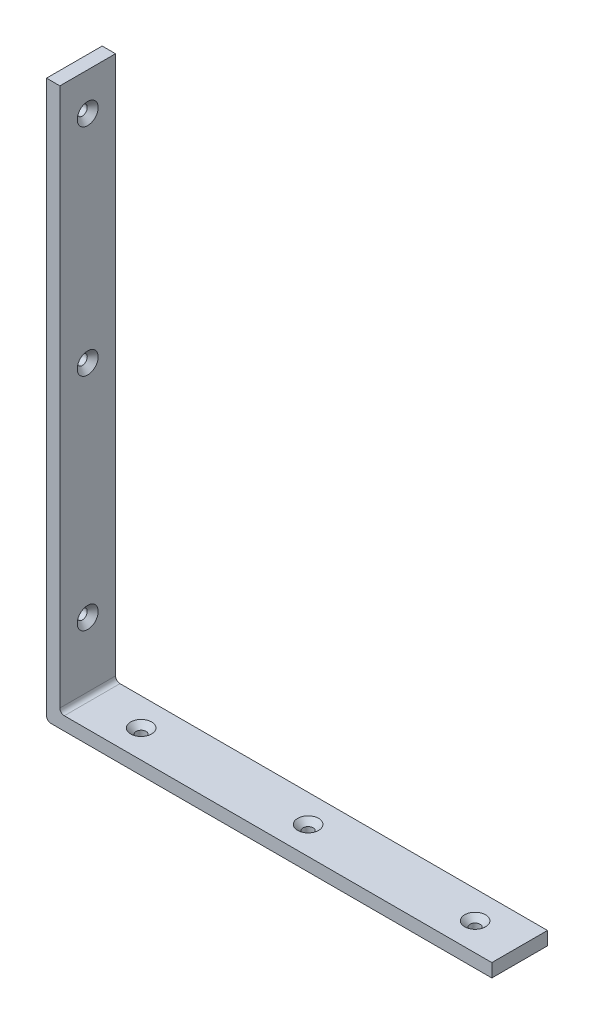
ISO-10303-21;
HEADER;
FILE_DESCRIPTION(('STEP AP214'),'2;1');
FILE_NAME('part.step','',(''),(''),'','','');
FILE_SCHEMA(('AUTOMOTIVE_DESIGN { 1 0 10303 214 1 1 1 1 }'));
ENDSEC;
DATA;
#1=APPLICATION_CONTEXT('core data for automotive mechanical design processes');
#2=APPLICATION_PROTOCOL_DEFINITION('international standard','automotive_design',2000,#1);
#3=PRODUCT_CONTEXT('',#1,'mechanical');
#4=PRODUCT('Part','Part','',(#3));
#5=PRODUCT_RELATED_PRODUCT_CATEGORY('part','',(#4));
#6=PRODUCT_DEFINITION_FORMATION('','',#4);
#7=PRODUCT_DEFINITION_CONTEXT('part definition',#1,'design');
#8=PRODUCT_DEFINITION('design','',#6,#7);
#9=PRODUCT_DEFINITION_SHAPE('','',#8);
#10=(LENGTH_UNIT() NAMED_UNIT(*) SI_UNIT(.MILLI.,.METRE.));
#11=(NAMED_UNIT(*) PLANE_ANGLE_UNIT() SI_UNIT($,.RADIAN.));
#12=(NAMED_UNIT(*) SI_UNIT($,.STERADIAN.) SOLID_ANGLE_UNIT());
#13=UNCERTAINTY_MEASURE_WITH_UNIT(LENGTH_MEASURE(1.E-05),#10,'distance_accuracy_value','');
#14=(GEOMETRIC_REPRESENTATION_CONTEXT(3) GLOBAL_UNCERTAINTY_ASSIGNED_CONTEXT((#13)) GLOBAL_UNIT_ASSIGNED_CONTEXT((#10,
#11,#12)) REPRESENTATION_CONTEXT('',''));
#15=CARTESIAN_POINT('',(0.,0.,0.));
#16=DIRECTION('',(0.,0.,1.));
#17=DIRECTION('',(1.,0.,0.));
#18=AXIS2_PLACEMENT_3D('',#15,#16,#17);
#19=CARTESIAN_POINT('',(100.,-119.,25.));
#20=DIRECTION('',(1.,0.,0.));
#21=DIRECTION('',(0.,0.,-1.));
#22=AXIS2_PLACEMENT_3D('',#19,#20,#21);
#23=PLANE('',#22);
#24=DIRECTION('',(0.,-1.,0.));
#25=VECTOR('',#24,1.);
#26=CARTESIAN_POINT('',(100.,-119.,0.));
#27=LINE('',#26,#25);
#28=CARTESIAN_POINT('',(100.,-119.,0.));
#29=VERTEX_POINT('',#28);
#30=CARTESIAN_POINT('',(100.,-125.,0.));
#31=VERTEX_POINT('',#30);
#32=EDGE_CURVE('E137',#29,#31,#27,.T.);
#33=ORIENTED_EDGE('',*,*,#32,.F.);
#34=DIRECTION('',(0.,0.,-1.));
#35=VECTOR('',#34,1.);
#36=CARTESIAN_POINT('',(100.,-119.,25.));
#37=LINE('',#36,#35);
#38=CARTESIAN_POINT('',(100.,-119.,25.));
#39=VERTEX_POINT('',#38);
#40=EDGE_CURVE('E120',#39,#29,#37,.T.);
#41=ORIENTED_EDGE('',*,*,#40,.F.);
#42=DIRECTION('',(0.,-1.,0.));
#43=VECTOR('',#42,1.);
#44=CARTESIAN_POINT('',(100.,-119.,25.));
#45=LINE('',#44,#43);
#46=CARTESIAN_POINT('',(100.,-125.,25.));
#47=VERTEX_POINT('',#46);
#48=EDGE_CURVE('E114',#39,#47,#45,.T.);
#49=ORIENTED_EDGE('',*,*,#48,.T.);
#50=DIRECTION('',(0.,0.,-1.));
#51=VECTOR('',#50,1.);
#52=CARTESIAN_POINT('',(100.,-125.,25.));
#53=LINE('',#52,#51);
#54=EDGE_CURVE('E96',#47,#31,#53,.T.);
#55=ORIENTED_EDGE('',*,*,#54,.T.);
#56=EDGE_LOOP('',(#33,#41,#49,#55));
#57=FACE_BOUND('',#56,.T.);
#58=ADVANCED_FACE('F33',(#57),#23,.T.);
#59=CARTESIAN_POINT('',(-94.,-119.,25.));
#60=DIRECTION('',(0.,1.,0.));
#61=DIRECTION('',(0.,0.,1.));
#62=AXIS2_PLACEMENT_3D('',#59,#60,#61);
#63=PLANE('',#62);
#64=CARTESIAN_POINT('',(-70.,-119.,12.5));
#65=DIRECTION('',(0.,1.,0.));
#66=DIRECTION('',(0.,0.,1.));
#67=AXIS2_PLACEMENT_3D('',#64,#65,#66);
#68=CIRCLE('',#67,4.7);
#69=CARTESIAN_POINT('',(-70.,-119.,17.2));
#70=VERTEX_POINT('',#69);
#71=EDGE_CURVE('E290',#70,#70,#68,.T.);
#72=ORIENTED_EDGE('',*,*,#71,.F.);
#73=EDGE_LOOP('',(#72));
#74=FACE_BOUND('',#73,.T.);
#75=CARTESIAN_POINT('',(5.,-119.,12.5));
#76=DIRECTION('',(0.,1.,0.));
#77=DIRECTION('',(0.,0.,1.));
#78=AXIS2_PLACEMENT_3D('',#75,#76,#77);
#79=CIRCLE('',#78,4.7);
#80=CARTESIAN_POINT('',(5.,-119.,17.2));
#81=VERTEX_POINT('',#80);
#82=EDGE_CURVE('E299',#81,#81,#79,.T.);
#83=ORIENTED_EDGE('',*,*,#82,.F.);
#84=EDGE_LOOP('',(#83));
#85=FACE_BOUND('',#84,.T.);
#86=CARTESIAN_POINT('',(80.,-119.,12.5));
#87=DIRECTION('',(0.,1.,0.));
#88=DIRECTION('',(0.,0.,1.));
#89=AXIS2_PLACEMENT_3D('',#86,#87,#88);
#90=CIRCLE('',#89,4.7);
#91=CARTESIAN_POINT('',(80.,-119.,17.2));
#92=VERTEX_POINT('',#91);
#93=EDGE_CURVE('E308',#92,#92,#90,.T.);
#94=ORIENTED_EDGE('',*,*,#93,.F.);
#95=EDGE_LOOP('',(#94));
#96=FACE_BOUND('',#95,.T.);
#97=DIRECTION('',(1.,0.,0.));
#98=VECTOR('',#97,1.);
#99=CARTESIAN_POINT('',(-94.,-119.,0.));
#100=LINE('',#99,#98);
#101=CARTESIAN_POINT('',(-92.,-119.,0.));
#102=VERTEX_POINT('',#101);
#103=EDGE_CURVE('E121',#102,#29,#100,.T.);
#104=ORIENTED_EDGE('',*,*,#103,.F.);
#105=DIRECTION('',(0.,0.,-1.));
#106=VECTOR('',#105,1.);
#107=CARTESIAN_POINT('',(-92.,-119.,25.));
#108=LINE('',#107,#106);
#109=CARTESIAN_POINT('',(-92.,-119.,25.));
#110=VERTEX_POINT('',#109);
#111=EDGE_CURVE('E155',#102,#110,#108,.F.);
#112=ORIENTED_EDGE('',*,*,#111,.T.);
#113=DIRECTION('',(1.,0.,0.));
#114=VECTOR('',#113,1.);
#115=CARTESIAN_POINT('',(-94.,-119.,25.));
#116=LINE('',#115,#114);
#117=EDGE_CURVE('E108',#110,#39,#116,.T.);
#118=ORIENTED_EDGE('',*,*,#117,.T.);
#119=ORIENTED_EDGE('',*,*,#40,.T.);
#120=EDGE_LOOP('',(#104,#112,#118,#119));
#121=FACE_BOUND('',#120,.T.);
#122=ADVANCED_FACE('F168',(#74,#85,#96,#121),#63,.T.);
#123=CARTESIAN_POINT('',(-94.,125.,25.));
#124=DIRECTION('',(1.,0.,0.));
#125=DIRECTION('',(0.,1.,0.));
#126=AXIS2_PLACEMENT_3D('',#123,#124,#125);
#127=PLANE('',#126);
#128=CARTESIAN_POINT('',(-94.,-88.,12.5));
#129=DIRECTION('',(1.,0.,0.));
#130=DIRECTION('',(0.,0.,-1.));
#131=AXIS2_PLACEMENT_3D('',#128,#129,#130);
#132=CIRCLE('',#131,4.7);
#133=CARTESIAN_POINT('',(-94.,-88.,7.80000000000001));
#134=VERTEX_POINT('',#133);
#135=EDGE_CURVE('E265',#134,#134,#132,.T.);
#136=ORIENTED_EDGE('',*,*,#135,.F.);
#137=EDGE_LOOP('',(#136));
#138=FACE_BOUND('',#137,.T.);
#139=CARTESIAN_POINT('',(-94.,11.,12.5));
#140=DIRECTION('',(1.,0.,0.));
#141=DIRECTION('',(0.,0.,-1.));
#142=AXIS2_PLACEMENT_3D('',#139,#140,#141);
#143=CIRCLE('',#142,4.7);
#144=CARTESIAN_POINT('',(-94.,11.,7.8));
#145=VERTEX_POINT('',#144);
#146=EDGE_CURVE('E272',#145,#145,#143,.T.);
#147=ORIENTED_EDGE('',*,*,#146,.F.);
#148=EDGE_LOOP('',(#147));
#149=FACE_BOUND('',#148,.T.);
#150=CARTESIAN_POINT('',(-94.,108.,12.5));
#151=DIRECTION('',(1.,0.,0.));
#152=DIRECTION('',(0.,0.,-1.));
#153=AXIS2_PLACEMENT_3D('',#150,#151,#152);
#154=CIRCLE('',#153,4.7);
#155=CARTESIAN_POINT('',(-94.,108.,7.80000000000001));
#156=VERTEX_POINT('',#155);
#157=EDGE_CURVE('E281',#156,#156,#154,.T.);
#158=ORIENTED_EDGE('',*,*,#157,.F.);
#159=EDGE_LOOP('',(#158));
#160=FACE_BOUND('',#159,.T.);
#161=DIRECTION('',(0.,-1.,0.));
#162=VECTOR('',#161,1.);
#163=CARTESIAN_POINT('',(-94.,125.,25.));
#164=LINE('',#163,#162);
#165=CARTESIAN_POINT('',(-94.,125.,25.));
#166=VERTEX_POINT('',#165);
#167=CARTESIAN_POINT('',(-94.,-117.,25.));
#168=VERTEX_POINT('',#167);
#169=EDGE_CURVE('E133',#166,#168,#164,.T.);
#170=ORIENTED_EDGE('',*,*,#169,.T.);
#171=DIRECTION('',(0.,0.,-1.));
#172=VECTOR('',#171,1.);
#173=CARTESIAN_POINT('',(-94.,-117.,0.));
#174=LINE('',#173,#172);
#175=CARTESIAN_POINT('',(-94.,-117.,0.));
#176=VERTEX_POINT('',#175);
#177=EDGE_CURVE('E148',#168,#176,#174,.T.);
#178=ORIENTED_EDGE('',*,*,#177,.T.);
#179=DIRECTION('',(0.,-1.,0.));
#180=VECTOR('',#179,1.);
#181=CARTESIAN_POINT('',(-94.,125.,0.));
#182=LINE('',#181,#180);
#183=CARTESIAN_POINT('',(-94.,125.,0.));
#184=VERTEX_POINT('',#183);
#185=EDGE_CURVE('E123',#184,#176,#182,.T.);
#186=ORIENTED_EDGE('',*,*,#185,.F.);
#187=DIRECTION('',(0.,0.,-1.));
#188=VECTOR('',#187,1.);
#189=CARTESIAN_POINT('',(-94.,125.,25.));
#190=LINE('',#189,#188);
#191=EDGE_CURVE('E149',#166,#184,#190,.T.);
#192=ORIENTED_EDGE('',*,*,#191,.F.);
#193=EDGE_LOOP('',(#170,#178,#186,#192));
#194=FACE_BOUND('',#193,.T.);
#195=ADVANCED_FACE('F176',(#138,#149,#160,#194),#127,.T.);
#196=CARTESIAN_POINT('',(-100.,125.,25.));
#197=DIRECTION('',(0.,1.,0.));
#198=DIRECTION('',(-1.,0.,0.));
#199=AXIS2_PLACEMENT_3D('',#196,#197,#198);
#200=PLANE('',#199);
#201=DIRECTION('',(1.,0.,0.));
#202=VECTOR('',#201,1.);
#203=CARTESIAN_POINT('',(-100.,125.,0.));
#204=LINE('',#203,#202);
#205=CARTESIAN_POINT('',(-100.,125.,0.));
#206=VERTEX_POINT('',#205);
#207=EDGE_CURVE('E142',#206,#184,#204,.T.);
#208=ORIENTED_EDGE('',*,*,#207,.F.);
#209=DIRECTION('',(0.,0.,-1.));
#210=VECTOR('',#209,1.);
#211=CARTESIAN_POINT('',(-100.,125.,25.));
#212=LINE('',#211,#210);
#213=CARTESIAN_POINT('',(-100.,125.,25.));
#214=VERTEX_POINT('',#213);
#215=EDGE_CURVE('E107',#214,#206,#212,.T.);
#216=ORIENTED_EDGE('',*,*,#215,.F.);
#217=DIRECTION('',(1.,0.,0.));
#218=VECTOR('',#217,1.);
#219=CARTESIAN_POINT('',(-100.,125.,25.));
#220=LINE('',#219,#218);
#221=EDGE_CURVE('E130',#214,#166,#220,.T.);
#222=ORIENTED_EDGE('',*,*,#221,.T.);
#223=ORIENTED_EDGE('',*,*,#191,.T.);
#224=EDGE_LOOP('',(#208,#216,#222,#223));
#225=FACE_BOUND('',#224,.T.);
#226=ADVANCED_FACE('F180',(#225),#200,.T.);
#227=CARTESIAN_POINT('',(-100.,-125.,25.));
#228=DIRECTION('',(-1.,0.,0.));
#229=DIRECTION('',(0.,0.,1.));
#230=AXIS2_PLACEMENT_3D('',#227,#228,#229);
#231=PLANE('',#230);
#232=CARTESIAN_POINT('',(-100.,-88.,12.5));
#233=DIRECTION('',(1.,0.,0.));
#234=DIRECTION('',(0.,0.,-1.));
#235=AXIS2_PLACEMENT_3D('',#232,#233,#234);
#236=CIRCLE('',#235,2.25);
#237=CARTESIAN_POINT('',(-100.,-88.,10.25));
#238=VERTEX_POINT('',#237);
#239=EDGE_CURVE('E267',#238,#238,#236,.T.);
#240=ORIENTED_EDGE('',*,*,#239,.T.);
#241=EDGE_LOOP('',(#240));
#242=FACE_BOUND('',#241,.T.);
#243=CARTESIAN_POINT('',(-100.,11.,12.5));
#244=DIRECTION('',(1.,0.,0.));
#245=DIRECTION('',(0.,0.,-1.));
#246=AXIS2_PLACEMENT_3D('',#243,#244,#245);
#247=CIRCLE('',#246,2.25);
#248=CARTESIAN_POINT('',(-100.,11.,10.25));
#249=VERTEX_POINT('',#248);
#250=EDGE_CURVE('E278',#249,#249,#247,.T.);
#251=ORIENTED_EDGE('',*,*,#250,.T.);
#252=EDGE_LOOP('',(#251));
#253=FACE_BOUND('',#252,.T.);
#254=CARTESIAN_POINT('',(-100.,108.,12.5));
#255=DIRECTION('',(1.,0.,0.));
#256=DIRECTION('',(0.,0.,-1.));
#257=AXIS2_PLACEMENT_3D('',#254,#255,#256);
#258=CIRCLE('',#257,2.25);
#259=CARTESIAN_POINT('',(-100.,108.,10.25));
#260=VERTEX_POINT('',#259);
#261=EDGE_CURVE('E287',#260,#260,#258,.T.);
#262=ORIENTED_EDGE('',*,*,#261,.T.);
#263=EDGE_LOOP('',(#262));
#264=FACE_BOUND('',#263,.T.);
#265=DIRECTION('',(0.,1.,0.));
#266=VECTOR('',#265,1.);
#267=CARTESIAN_POINT('',(-100.,-125.,0.));
#268=LINE('',#267,#266);
#269=CARTESIAN_POINT('',(-100.,-123.,0.));
#270=VERTEX_POINT('',#269);
#271=EDGE_CURVE('E140',#270,#206,#268,.T.);
#272=ORIENTED_EDGE('',*,*,#271,.F.);
#273=DIRECTION('',(0.,0.,-1.));
#274=VECTOR('',#273,1.);
#275=CARTESIAN_POINT('',(-100.,-123.,25.));
#276=LINE('',#275,#274);
#277=CARTESIAN_POINT('',(-100.,-123.,25.));
#278=VERTEX_POINT('',#277);
#279=EDGE_CURVE('E41',#270,#278,#276,.F.);
#280=ORIENTED_EDGE('',*,*,#279,.T.);
#281=DIRECTION('',(0.,1.,0.));
#282=VECTOR('',#281,1.);
#283=CARTESIAN_POINT('',(-100.,-125.,25.));
#284=LINE('',#283,#282);
#285=EDGE_CURVE('E116',#278,#214,#284,.T.);
#286=ORIENTED_EDGE('',*,*,#285,.T.);
#287=ORIENTED_EDGE('',*,*,#215,.T.);
#288=EDGE_LOOP('',(#272,#280,#286,#287));
#289=FACE_BOUND('',#288,.T.);
#290=ADVANCED_FACE('F201',(#242,#253,#264,#289),#231,.T.);
#291=CARTESIAN_POINT('',(100.,-125.,25.));
#292=DIRECTION('',(0.,-1.,0.));
#293=DIRECTION('',(1.,0.,0.));
#294=AXIS2_PLACEMENT_3D('',#291,#292,#293);
#295=PLANE('',#294);
#296=CARTESIAN_POINT('',(-70.,-125.,12.5));
#297=DIRECTION('',(0.,1.,0.));
#298=DIRECTION('',(0.,0.,1.));
#299=AXIS2_PLACEMENT_3D('',#296,#297,#298);
#300=CIRCLE('',#299,2.25);
#301=CARTESIAN_POINT('',(-70.,-125.,14.75));
#302=VERTEX_POINT('',#301);
#303=EDGE_CURVE('E296',#302,#302,#300,.T.);
#304=ORIENTED_EDGE('',*,*,#303,.T.);
#305=EDGE_LOOP('',(#304));
#306=FACE_BOUND('',#305,.T.);
#307=CARTESIAN_POINT('',(5.,-125.,12.5));
#308=DIRECTION('',(0.,1.,0.));
#309=DIRECTION('',(0.,0.,1.));
#310=AXIS2_PLACEMENT_3D('',#307,#308,#309);
#311=CIRCLE('',#310,2.25);
#312=CARTESIAN_POINT('',(5.,-125.,14.75));
#313=VERTEX_POINT('',#312);
#314=EDGE_CURVE('E305',#313,#313,#311,.T.);
#315=ORIENTED_EDGE('',*,*,#314,.T.);
#316=EDGE_LOOP('',(#315));
#317=FACE_BOUND('',#316,.T.);
#318=CARTESIAN_POINT('',(80.,-125.,12.5));
#319=DIRECTION('',(0.,1.,0.));
#320=DIRECTION('',(0.,0.,1.));
#321=AXIS2_PLACEMENT_3D('',#318,#319,#320);
#322=CIRCLE('',#321,2.25);
#323=CARTESIAN_POINT('',(80.,-125.,14.75));
#324=VERTEX_POINT('',#323);
#325=EDGE_CURVE('E126',#324,#324,#322,.T.);
#326=ORIENTED_EDGE('',*,*,#325,.T.);
#327=EDGE_LOOP('',(#326));
#328=FACE_BOUND('',#327,.T.);
#329=DIRECTION('',(-1.,0.,0.));
#330=VECTOR('',#329,1.);
#331=CARTESIAN_POINT('',(100.,-125.,25.));
#332=LINE('',#331,#330);
#333=CARTESIAN_POINT('',(-98.,-125.,25.));
#334=VERTEX_POINT('',#333);
#335=EDGE_CURVE('E100',#47,#334,#332,.T.);
#336=ORIENTED_EDGE('',*,*,#335,.T.);
#337=DIRECTION('',(0.,0.,-1.));
#338=VECTOR('',#337,1.);
#339=CARTESIAN_POINT('',(-98.,-125.,25.));
#340=LINE('',#339,#338);
#341=CARTESIAN_POINT('',(-98.,-125.,0.));
#342=VERTEX_POINT('',#341);
#343=EDGE_CURVE('E161',#334,#342,#340,.T.);
#344=ORIENTED_EDGE('',*,*,#343,.T.);
#345=DIRECTION('',(-1.,0.,0.));
#346=VECTOR('',#345,1.);
#347=CARTESIAN_POINT('',(100.,-125.,0.));
#348=LINE('',#347,#346);
#349=EDGE_CURVE('E102',#31,#342,#348,.T.);
#350=ORIENTED_EDGE('',*,*,#349,.F.);
#351=ORIENTED_EDGE('',*,*,#54,.F.);
#352=EDGE_LOOP('',(#336,#344,#350,#351));
#353=FACE_BOUND('',#352,.T.);
#354=ADVANCED_FACE('F98',(#306,#317,#328,#353),#295,.T.);
#355=CARTESIAN_POINT('',(0.,0.,25.));
#356=DIRECTION('',(0.,0.,-1.));
#357=DIRECTION('',(-1.,0.,0.));
#358=AXIS2_PLACEMENT_3D('',#355,#356,#357);
#359=PLANE('',#358);
#360=ORIENTED_EDGE('',*,*,#285,.F.);
#361=CARTESIAN_POINT('',(-98.,-123.,25.));
#362=DIRECTION('',(0.,0.,-1.));
#363=DIRECTION('',(-1.,0.,0.));
#364=AXIS2_PLACEMENT_3D('',#361,#362,#363);
#365=CIRCLE('',#364,2.);
#366=EDGE_CURVE('E11',#278,#334,#365,.F.);
#367=ORIENTED_EDGE('',*,*,#366,.T.);
#368=ORIENTED_EDGE('',*,*,#335,.F.);
#369=ORIENTED_EDGE('',*,*,#48,.F.);
#370=ORIENTED_EDGE('',*,*,#117,.F.);
#371=CARTESIAN_POINT('',(-92.,-117.,25.));
#372=DIRECTION('',(0.,0.,-1.));
#373=DIRECTION('',(-1.,0.,0.));
#374=AXIS2_PLACEMENT_3D('',#371,#372,#373);
#375=CIRCLE('',#374,2.);
#376=EDGE_CURVE('E159',#110,#168,#375,.T.);
#377=ORIENTED_EDGE('',*,*,#376,.T.);
#378=ORIENTED_EDGE('',*,*,#169,.F.);
#379=ORIENTED_EDGE('',*,*,#221,.F.);
#380=EDGE_LOOP('',(#360,#367,#368,#369,#370,#377,#378,#379));
#381=FACE_BOUND('',#380,.T.);
#382=ADVANCED_FACE('F112',(#381),#359,.F.);
#383=CARTESIAN_POINT('',(0.,0.,0.));
#384=DIRECTION('',(0.,0.,-1.));
#385=DIRECTION('',(-1.,0.,0.));
#386=AXIS2_PLACEMENT_3D('',#383,#384,#385);
#387=PLANE('',#386);
#388=ORIENTED_EDGE('',*,*,#349,.T.);
#389=CARTESIAN_POINT('',(-98.,-123.,0.));
#390=DIRECTION('',(0.,0.,-1.));
#391=DIRECTION('',(-1.,0.,0.));
#392=AXIS2_PLACEMENT_3D('',#389,#390,#391);
#393=CIRCLE('',#392,2.);
#394=EDGE_CURVE('E55',#342,#270,#393,.T.);
#395=ORIENTED_EDGE('',*,*,#394,.T.);
#396=ORIENTED_EDGE('',*,*,#271,.T.);
#397=ORIENTED_EDGE('',*,*,#207,.T.);
#398=ORIENTED_EDGE('',*,*,#185,.T.);
#399=CARTESIAN_POINT('',(-92.,-117.,0.));
#400=DIRECTION('',(0.,0.,-1.));
#401=DIRECTION('',(-1.,0.,0.));
#402=AXIS2_PLACEMENT_3D('',#399,#400,#401);
#403=CIRCLE('',#402,2.);
#404=EDGE_CURVE('E157',#176,#102,#403,.F.);
#405=ORIENTED_EDGE('',*,*,#404,.T.);
#406=ORIENTED_EDGE('',*,*,#103,.T.);
#407=ORIENTED_EDGE('',*,*,#32,.T.);
#408=EDGE_LOOP('',(#388,#395,#396,#397,#398,#405,#406,#407));
#409=FACE_BOUND('',#408,.T.);
#410=ADVANCED_FACE('F164',(#409),#387,.T.);
#411=CARTESIAN_POINT('',(-92.,-117.,25.));
#412=DIRECTION('',(0.,0.,1.));
#413=DIRECTION('',(1.,0.,0.));
#414=AXIS2_PLACEMENT_3D('',#411,#412,#413);
#415=CYLINDRICAL_SURFACE('',#414,2.);
#416=ORIENTED_EDGE('',*,*,#376,.F.);
#417=ORIENTED_EDGE('',*,*,#111,.F.);
#418=ORIENTED_EDGE('',*,*,#404,.F.);
#419=ORIENTED_EDGE('',*,*,#177,.F.);
#420=EDGE_LOOP('',(#416,#417,#418,#419));
#421=FACE_BOUND('',#420,.T.);
#422=ADVANCED_FACE('F173',(#421),#415,.F.);
#423=CARTESIAN_POINT('',(-98.,-123.,25.));
#424=DIRECTION('',(0.,0.,-1.));
#425=DIRECTION('',(-1.,0.,0.));
#426=AXIS2_PLACEMENT_3D('',#423,#424,#425);
#427=CYLINDRICAL_SURFACE('',#426,2.);
#428=ORIENTED_EDGE('',*,*,#366,.F.);
#429=ORIENTED_EDGE('',*,*,#279,.F.);
#430=ORIENTED_EDGE('',*,*,#394,.F.);
#431=ORIENTED_EDGE('',*,*,#343,.F.);
#432=EDGE_LOOP('',(#428,#429,#430,#431));
#433=FACE_BOUND('',#432,.T.);
#434=ADVANCED_FACE('F35',(#433),#427,.T.);
#435=CARTESIAN_POINT('',(80.,-119.,12.5));
#436=DIRECTION('',(0.,1.,0.));
#437=DIRECTION('',(0.,0.,1.));
#438=AXIS2_PLACEMENT_3D('',#435,#436,#437);
#439=CYLINDRICAL_SURFACE('',#438,2.25);
#440=ORIENTED_EDGE('',*,*,#325,.F.);
#441=EDGE_LOOP('',(#440));
#442=FACE_BOUND('',#441,.T.);
#443=CARTESIAN_POINT('',(80.,-121.45,12.5));
#444=DIRECTION('',(0.,1.,0.));
#445=DIRECTION('',(0.,0.,1.));
#446=AXIS2_PLACEMENT_3D('',#443,#444,#445);
#447=CIRCLE('',#446,2.25);
#448=CARTESIAN_POINT('',(80.,-121.45,14.75));
#449=VERTEX_POINT('',#448);
#450=EDGE_CURVE('E310',#449,#449,#447,.T.);
#451=ORIENTED_EDGE('',*,*,#450,.T.);
#452=EDGE_LOOP('',(#451));
#453=FACE_BOUND('',#452,.T.);
#454=ADVANCED_FACE('F183',(#442,#453),#439,.F.);
#455=CARTESIAN_POINT('',(80.,-119.,12.5));
#456=DIRECTION('',(0.,1.,0.));
#457=DIRECTION('',(0.,0.,1.));
#458=AXIS2_PLACEMENT_3D('',#455,#456,#457);
#459=CONICAL_SURFACE('',#458,4.7,0.785398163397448);
#460=ORIENTED_EDGE('',*,*,#450,.F.);
#461=EDGE_LOOP('',(#460));
#462=FACE_BOUND('',#461,.T.);
#463=ORIENTED_EDGE('',*,*,#93,.T.);
#464=EDGE_LOOP('',(#463));
#465=FACE_BOUND('',#464,.T.);
#466=ADVANCED_FACE('F188',(#462,#465),#459,.F.);
#467=CARTESIAN_POINT('',(5.,-119.,12.5));
#468=DIRECTION('',(0.,1.,0.));
#469=DIRECTION('',(0.,0.,1.));
#470=AXIS2_PLACEMENT_3D('',#467,#468,#469);
#471=CYLINDRICAL_SURFACE('',#470,2.25);
#472=ORIENTED_EDGE('',*,*,#314,.F.);
#473=EDGE_LOOP('',(#472));
#474=FACE_BOUND('',#473,.T.);
#475=CARTESIAN_POINT('',(5.,-121.45,12.5));
#476=DIRECTION('',(0.,1.,0.));
#477=DIRECTION('',(0.,0.,1.));
#478=AXIS2_PLACEMENT_3D('',#475,#476,#477);
#479=CIRCLE('',#478,2.25);
#480=CARTESIAN_POINT('',(5.,-121.45,14.75));
#481=VERTEX_POINT('',#480);
#482=EDGE_CURVE('E302',#481,#481,#479,.T.);
#483=ORIENTED_EDGE('',*,*,#482,.T.);
#484=EDGE_LOOP('',(#483));
#485=FACE_BOUND('',#484,.T.);
#486=ADVANCED_FACE('F217',(#474,#485),#471,.F.);
#487=CARTESIAN_POINT('',(5.,-119.,12.5));
#488=DIRECTION('',(0.,1.,0.));
#489=DIRECTION('',(0.,0.,1.));
#490=AXIS2_PLACEMENT_3D('',#487,#488,#489);
#491=CONICAL_SURFACE('',#490,4.7,0.785398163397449);
#492=ORIENTED_EDGE('',*,*,#482,.F.);
#493=EDGE_LOOP('',(#492));
#494=FACE_BOUND('',#493,.T.);
#495=ORIENTED_EDGE('',*,*,#82,.T.);
#496=EDGE_LOOP('',(#495));
#497=FACE_BOUND('',#496,.T.);
#498=ADVANCED_FACE('F221',(#494,#497),#491,.F.);
#499=CARTESIAN_POINT('',(-70.,-119.,12.5));
#500=DIRECTION('',(0.,1.,0.));
#501=DIRECTION('',(0.,0.,1.));
#502=AXIS2_PLACEMENT_3D('',#499,#500,#501);
#503=CYLINDRICAL_SURFACE('',#502,2.25);
#504=ORIENTED_EDGE('',*,*,#303,.F.);
#505=EDGE_LOOP('',(#504));
#506=FACE_BOUND('',#505,.T.);
#507=CARTESIAN_POINT('',(-70.,-121.45,12.5));
#508=DIRECTION('',(0.,1.,0.));
#509=DIRECTION('',(0.,0.,1.));
#510=AXIS2_PLACEMENT_3D('',#507,#508,#509);
#511=CIRCLE('',#510,2.25);
#512=CARTESIAN_POINT('',(-70.,-121.45,14.75));
#513=VERTEX_POINT('',#512);
#514=EDGE_CURVE('E293',#513,#513,#511,.T.);
#515=ORIENTED_EDGE('',*,*,#514,.T.);
#516=EDGE_LOOP('',(#515));
#517=FACE_BOUND('',#516,.T.);
#518=ADVANCED_FACE('F225',(#506,#517),#503,.F.);
#519=CARTESIAN_POINT('',(-70.,-119.,12.5));
#520=DIRECTION('',(0.,1.,0.));
#521=DIRECTION('',(0.,0.,1.));
#522=AXIS2_PLACEMENT_3D('',#519,#520,#521);
#523=CONICAL_SURFACE('',#522,4.7,0.785398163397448);
#524=ORIENTED_EDGE('',*,*,#514,.F.);
#525=EDGE_LOOP('',(#524));
#526=FACE_BOUND('',#525,.T.);
#527=ORIENTED_EDGE('',*,*,#71,.T.);
#528=EDGE_LOOP('',(#527));
#529=FACE_BOUND('',#528,.T.);
#530=ADVANCED_FACE('F229',(#526,#529),#523,.F.);
#531=CARTESIAN_POINT('',(-94.,108.,12.5));
#532=DIRECTION('',(1.,0.,0.));
#533=DIRECTION('',(0.,0.,-1.));
#534=AXIS2_PLACEMENT_3D('',#531,#532,#533);
#535=CYLINDRICAL_SURFACE('',#534,2.25);
#536=ORIENTED_EDGE('',*,*,#261,.F.);
#537=EDGE_LOOP('',(#536));
#538=FACE_BOUND('',#537,.T.);
#539=CARTESIAN_POINT('',(-96.45,108.,12.5));
#540=DIRECTION('',(1.,0.,0.));
#541=DIRECTION('',(0.,0.,-1.));
#542=AXIS2_PLACEMENT_3D('',#539,#540,#541);
#543=CIRCLE('',#542,2.24999999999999);
#544=CARTESIAN_POINT('',(-96.45,108.,10.25));
#545=VERTEX_POINT('',#544);
#546=EDGE_CURVE('E284',#545,#545,#543,.T.);
#547=ORIENTED_EDGE('',*,*,#546,.T.);
#548=EDGE_LOOP('',(#547));
#549=FACE_BOUND('',#548,.T.);
#550=ADVANCED_FACE('F233',(#538,#549),#535,.F.);
#551=CARTESIAN_POINT('',(-94.,108.,12.5));
#552=DIRECTION('',(1.,0.,0.));
#553=DIRECTION('',(0.,0.,-1.));
#554=AXIS2_PLACEMENT_3D('',#551,#552,#553);
#555=CONICAL_SURFACE('',#554,4.7,0.785398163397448);
#556=ORIENTED_EDGE('',*,*,#546,.F.);
#557=EDGE_LOOP('',(#556));
#558=FACE_BOUND('',#557,.T.);
#559=ORIENTED_EDGE('',*,*,#157,.T.);
#560=EDGE_LOOP('',(#559));
#561=FACE_BOUND('',#560,.T.);
#562=ADVANCED_FACE('F237',(#558,#561),#555,.F.);
#563=CARTESIAN_POINT('',(-94.,11.,12.5));
#564=DIRECTION('',(1.,0.,0.));
#565=DIRECTION('',(0.,0.,-1.));
#566=AXIS2_PLACEMENT_3D('',#563,#564,#565);
#567=CYLINDRICAL_SURFACE('',#566,2.24999999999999);
#568=ORIENTED_EDGE('',*,*,#250,.F.);
#569=EDGE_LOOP('',(#568));
#570=FACE_BOUND('',#569,.T.);
#571=CARTESIAN_POINT('',(-96.45,11.,12.5));
#572=DIRECTION('',(1.,0.,0.));
#573=DIRECTION('',(0.,0.,-1.));
#574=AXIS2_PLACEMENT_3D('',#571,#572,#573);
#575=CIRCLE('',#574,2.24999999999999);
#576=CARTESIAN_POINT('',(-96.45,11.,10.25));
#577=VERTEX_POINT('',#576);
#578=EDGE_CURVE('E275',#577,#577,#575,.T.);
#579=ORIENTED_EDGE('',*,*,#578,.T.);
#580=EDGE_LOOP('',(#579));
#581=FACE_BOUND('',#580,.T.);
#582=ADVANCED_FACE('F241',(#570,#581),#567,.F.);
#583=CARTESIAN_POINT('',(-94.,11.,12.5));
#584=DIRECTION('',(1.,0.,0.));
#585=DIRECTION('',(0.,0.,-1.));
#586=AXIS2_PLACEMENT_3D('',#583,#584,#585);
#587=CONICAL_SURFACE('',#586,4.7,0.785398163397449);
#588=ORIENTED_EDGE('',*,*,#578,.F.);
#589=EDGE_LOOP('',(#588));
#590=FACE_BOUND('',#589,.T.);
#591=ORIENTED_EDGE('',*,*,#146,.T.);
#592=EDGE_LOOP('',(#591));
#593=FACE_BOUND('',#592,.T.);
#594=ADVANCED_FACE('F245',(#590,#593),#587,.F.);
#595=CARTESIAN_POINT('',(-94.,-88.,12.5));
#596=DIRECTION('',(1.,0.,0.));
#597=DIRECTION('',(0.,0.,-1.));
#598=AXIS2_PLACEMENT_3D('',#595,#596,#597);
#599=CYLINDRICAL_SURFACE('',#598,2.25);
#600=ORIENTED_EDGE('',*,*,#239,.F.);
#601=EDGE_LOOP('',(#600));
#602=FACE_BOUND('',#601,.T.);
#603=CARTESIAN_POINT('',(-96.45,-88.,12.5));
#604=DIRECTION('',(1.,0.,0.));
#605=DIRECTION('',(0.,0.,-1.));
#606=AXIS2_PLACEMENT_3D('',#603,#604,#605);
#607=CIRCLE('',#606,2.24999999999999);
#608=CARTESIAN_POINT('',(-96.45,-88.,10.25));
#609=VERTEX_POINT('',#608);
#610=EDGE_CURVE('E262',#609,#609,#607,.T.);
#611=ORIENTED_EDGE('',*,*,#610,.T.);
#612=EDGE_LOOP('',(#611));
#613=FACE_BOUND('',#612,.T.);
#614=ADVANCED_FACE('F249',(#602,#613),#599,.F.);
#615=CARTESIAN_POINT('',(-94.,-88.,12.5));
#616=DIRECTION('',(1.,0.,0.));
#617=DIRECTION('',(0.,0.,-1.));
#618=AXIS2_PLACEMENT_3D('',#615,#616,#617);
#619=CONICAL_SURFACE('',#618,4.7,0.785398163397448);
#620=ORIENTED_EDGE('',*,*,#610,.F.);
#621=EDGE_LOOP('',(#620));
#622=FACE_BOUND('',#621,.T.);
#623=ORIENTED_EDGE('',*,*,#135,.T.);
#624=EDGE_LOOP('',(#623));
#625=FACE_BOUND('',#624,.T.);
#626=ADVANCED_FACE('F253',(#622,#625),#619,.F.);
#627=CLOSED_SHELL('',(#58,#122,#195,#226,#290,#354,#382,#410,#422,#434,#454,#466,#486,#498,#518,
#530,#550,#562,#582,#594,#614,#626));
#628=MANIFOLD_SOLID_BREP('B2',#627);
#629=ADVANCED_BREP_SHAPE_REPRESENTATION('',(#18,#628),#14);
#630=SHAPE_DEFINITION_REPRESENTATION(#9,#629);
ENDSEC;
END-ISO-10303-21;
